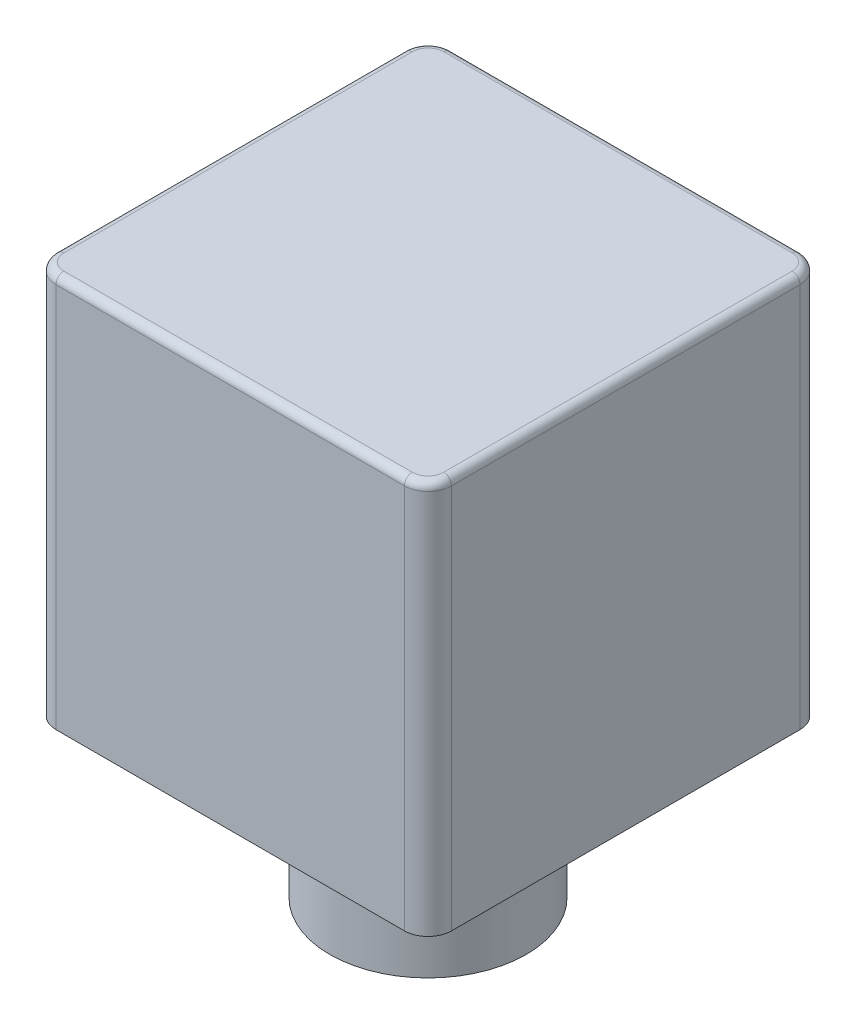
from build123d import *

# Parameters (mm, degrees)
SKETCH1_R      = 12.5
EXTRUDE1_DEPTH = 20
SKETCH2_W      = 50.295598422
SKETCH2_H      = 50.295598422
EXTRUDE2_DEPTH = 50
FILLET1_R      = 3
FILLET3_R      = 1


with BuildPart() as part:
    # Sketch1 → Extrude1 (new body)
    with BuildSketch(Plane(origin=(0, 0, 0), x_dir=(1, 0, 0), z_dir=(0, 1, 0))):
        with Locations(Location((0, 0, 0), (0, 0, 270))):
            Circle(SKETCH1_R)
        with BuildLine():
            Line((4.5, 6), (4.5, -6))
            ThreePointArc((4.5, -6), (-7.5, 0), (4.5, 6))
        make_face(mode=Mode.SUBTRACT)
    extrude(amount=EXTRUDE1_DEPTH)

    # Sketch2 → Extrude2 (add)
    with BuildSketch(Plane(origin=(0, 20, 0), x_dir=(-1, 0, 0), z_dir=(0, 1, 0))):
        Rectangle(SKETCH2_W, SKETCH2_H)
    extrude(amount=EXTRUDE2_DEPTH)

    # Fillet1
    fillet1_edges = [part.edges().sort_by_distance(p)[0] for p in [
        (25.147799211, 45, 25.147799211),
        (25.147799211, 45, -25.147799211),
        (-25.147799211, 45, -25.147799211),
        (-25.147799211, 45, 25.147799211),
        (0, 20, -12.5),
    ]]
    fillet(fillet1_edges, radius=FILLET1_R)

    # Fillet3
    fillet3_edges = [part.edges().sort_by_distance(p)[0] for p in [
        (0, 70, 25.147799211),
        (-25.147799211, 70, 0),
        (25.147799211, 70, 0),
        (0, 70, -25.147799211),
        (24.269119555, 70, -24.269119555),
        (24.269119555, 70, 24.269119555),
        (-24.269119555, 70, -24.269119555),
        (-24.269119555, 70, 24.269119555),
    ]]
    fillet(fillet3_edges, radius=FILLET3_R)


solid = part.part
